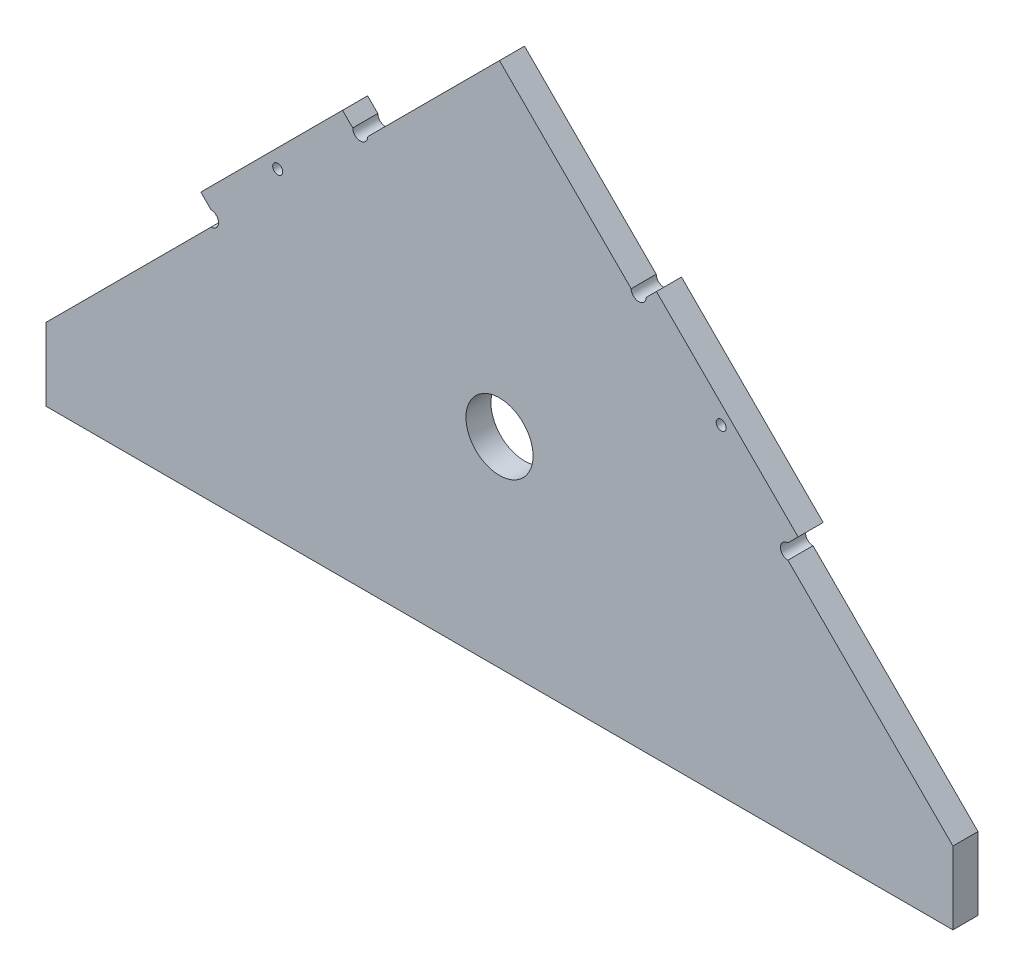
ISO-10303-21;
HEADER;
FILE_DESCRIPTION(('STEP AP214'),'2;1');
FILE_NAME('part.step','',(''),(''),'','','');
FILE_SCHEMA(('AUTOMOTIVE_DESIGN { 1 0 10303 214 1 1 1 1 }'));
ENDSEC;
DATA;
#1=APPLICATION_CONTEXT('core data for automotive mechanical design processes');
#2=APPLICATION_PROTOCOL_DEFINITION('international standard','automotive_design',2000,#1);
#3=PRODUCT_CONTEXT('',#1,'mechanical');
#4=PRODUCT('Part','Part','',(#3));
#5=PRODUCT_RELATED_PRODUCT_CATEGORY('part','',(#4));
#6=PRODUCT_DEFINITION_FORMATION('','',#4);
#7=PRODUCT_DEFINITION_CONTEXT('part definition',#1,'design');
#8=PRODUCT_DEFINITION('design','',#6,#7);
#9=PRODUCT_DEFINITION_SHAPE('','',#8);
#10=(LENGTH_UNIT() NAMED_UNIT(*) SI_UNIT(.MILLI.,.METRE.));
#11=(NAMED_UNIT(*) PLANE_ANGLE_UNIT() SI_UNIT($,.RADIAN.));
#12=(NAMED_UNIT(*) SI_UNIT($,.STERADIAN.) SOLID_ANGLE_UNIT());
#13=UNCERTAINTY_MEASURE_WITH_UNIT(LENGTH_MEASURE(1.E-05),#10,'distance_accuracy_value','');
#14=(GEOMETRIC_REPRESENTATION_CONTEXT(3) GLOBAL_UNCERTAINTY_ASSIGNED_CONTEXT((#13)) GLOBAL_UNIT_ASSIGNED_CONTEXT((#10,
#11,#12)) REPRESENTATION_CONTEXT('',''));
#15=CARTESIAN_POINT('',(0.,0.,0.));
#16=DIRECTION('',(0.,0.,1.));
#17=DIRECTION('',(1.,0.,0.));
#18=AXIS2_PLACEMENT_3D('',#15,#16,#17);
#19=CARTESIAN_POINT('',(-57.568542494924,48.9314575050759,5.));
#20=DIRECTION('',(0.,0.,-1.));
#21=DIRECTION('',(-1.,0.,0.));
#22=AXIS2_PLACEMENT_3D('',#19,#20,#21);
#23=PLANE('',#22);
#24=CARTESIAN_POINT('',(0.,40.,5.));
#25=DIRECTION('',(0.,0.,1.));
#26=DIRECTION('',(1.,0.,0.));
#27=AXIS2_PLACEMENT_3D('',#24,#25,#26);
#28=CIRCLE('',#27,6.7);
#29=CARTESIAN_POINT('',(6.7,40.,5.));
#30=VERTEX_POINT('',#29);
#31=EDGE_CURVE('E346',#30,#30,#28,.T.);
#32=ORIENTED_EDGE('',*,*,#31,.F.);
#33=EDGE_LOOP('',(#32));
#34=FACE_BOUND('',#33,.T.);
#35=CARTESIAN_POINT('',(-44.2533933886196,64.1223634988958,5.));
#36=DIRECTION('',(0.,0.,1.));
#37=DIRECTION('',(-1.,0.,0.));
#38=AXIS2_PLACEMENT_3D('',#35,#36,#37);
#39=CIRCLE('',#38,1.00000000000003);
#40=CARTESIAN_POINT('',(-45.2533933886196,64.1223634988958,5.));
#41=VERTEX_POINT('',#40);
#42=EDGE_CURVE('E188',#41,#41,#39,.T.);
#43=ORIENTED_EDGE('',*,*,#42,.F.);
#44=EDGE_LOOP('',(#43));
#45=FACE_BOUND('',#44,.T.);
#46=DIRECTION('',(-0.707106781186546,0.707106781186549,0.));
#47=VECTOR('',#46,1.);
#48=CARTESIAN_POINT('',(-29.2842712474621,78.7157287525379,5.));
#49=LINE('',#48,#47);
#50=CARTESIAN_POINT('',(-29.2842712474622,78.7157287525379,5.));
#51=VERTEX_POINT('',#50);
#52=CARTESIAN_POINT('',(-31.3198051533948,80.7512626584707,5.));
#53=VERTEX_POINT('',#52);
#54=EDGE_CURVE('E217',#51,#53,#49,.T.);
#55=ORIENTED_EDGE('',*,*,#54,.T.);
#56=DIRECTION('',(-0.707106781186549,-0.707106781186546,0.));
#57=VECTOR('',#56,1.);
#58=CARTESIAN_POINT('',(-31.3198051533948,80.7512626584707,5.));
#59=LINE('',#58,#57);
#60=CARTESIAN_POINT('',(-59.6040764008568,52.4669914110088,5.));
#61=VERTEX_POINT('',#60);
#62=EDGE_CURVE('E120',#53,#61,#59,.T.);
#63=ORIENTED_EDGE('',*,*,#62,.T.);
#64=DIRECTION('',(0.70710678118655,-0.707106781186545,0.));
#65=VECTOR('',#64,1.);
#66=CARTESIAN_POINT('',(-59.6040764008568,52.4669914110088,5.));
#67=LINE('',#66,#65);
#68=CARTESIAN_POINT('',(-57.5685424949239,50.4314575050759,5.));
#69=VERTEX_POINT('',#68);
#70=EDGE_CURVE('E260',#61,#69,#67,.T.);
#71=ORIENTED_EDGE('',*,*,#70,.T.);
#72=CARTESIAN_POINT('',(-57.568542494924,48.9314575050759,5.));
#73=DIRECTION('',(0.,0.,-1.));
#74=DIRECTION('',(-1.,0.,0.));
#75=AXIS2_PLACEMENT_3D('',#72,#73,#74);
#76=CIRCLE('',#75,1.5);
#77=CARTESIAN_POINT('',(-57.568542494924,47.4314575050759,5.));
#78=VERTEX_POINT('',#77);
#79=EDGE_CURVE('E279',#69,#78,#76,.T.);
#80=ORIENTED_EDGE('',*,*,#79,.T.);
#81=DIRECTION('',(-0.70710678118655,-0.707106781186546,0.));
#82=VECTOR('',#81,1.);
#83=CARTESIAN_POINT('',(-90.5,14.5,5.));
#84=LINE('',#83,#82);
#85=CARTESIAN_POINT('',(-90.5,14.5,5.));
#86=VERTEX_POINT('',#85);
#87=EDGE_CURVE('E276',#78,#86,#84,.T.);
#88=ORIENTED_EDGE('',*,*,#87,.T.);
#89=DIRECTION('',(0.,-1.,0.));
#90=VECTOR('',#89,1.);
#91=CARTESIAN_POINT('',(-90.5,0.,5.));
#92=LINE('',#91,#90);
#93=CARTESIAN_POINT('',(-90.5,0.,5.));
#94=VERTEX_POINT('',#93);
#95=EDGE_CURVE('E278',#86,#94,#92,.T.);
#96=ORIENTED_EDGE('',*,*,#95,.T.);
#97=DIRECTION('',(1.,0.,0.));
#98=VECTOR('',#97,1.);
#99=CARTESIAN_POINT('',(90.5,0.,5.));
#100=LINE('',#99,#98);
#101=CARTESIAN_POINT('',(90.5,0.,5.));
#102=VERTEX_POINT('',#101);
#103=EDGE_CURVE('E281',#94,#102,#100,.T.);
#104=ORIENTED_EDGE('',*,*,#103,.T.);
#105=DIRECTION('',(0.,1.,0.));
#106=VECTOR('',#105,1.);
#107=CARTESIAN_POINT('',(90.5,0.,5.));
#108=LINE('',#107,#106);
#109=CARTESIAN_POINT('',(90.5000000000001,14.5,5.));
#110=VERTEX_POINT('',#109);
#111=EDGE_CURVE('E287',#102,#110,#108,.T.);
#112=ORIENTED_EDGE('',*,*,#111,.T.);
#113=DIRECTION('',(-0.70710678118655,0.707106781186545,0.));
#114=VECTOR('',#113,1.);
#115=CARTESIAN_POINT('',(90.5000000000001,14.5,5.));
#116=LINE('',#115,#114);
#117=CARTESIAN_POINT('',(57.568542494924,47.4314575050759,5.));
#118=VERTEX_POINT('',#117);
#119=EDGE_CURVE('E289',#110,#118,#116,.T.);
#120=ORIENTED_EDGE('',*,*,#119,.T.);
#121=CARTESIAN_POINT('',(57.568542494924,48.9314575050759,5.));
#122=DIRECTION('',(0.,0.,-1.));
#123=DIRECTION('',(1.,0.,0.));
#124=AXIS2_PLACEMENT_3D('',#121,#122,#123);
#125=CIRCLE('',#124,1.5);
#126=CARTESIAN_POINT('',(57.5685424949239,50.4314575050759,5.));
#127=VERTEX_POINT('',#126);
#128=EDGE_CURVE('E291',#118,#127,#125,.T.);
#129=ORIENTED_EDGE('',*,*,#128,.T.);
#130=DIRECTION('',(0.707106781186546,0.707106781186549,0.));
#131=VECTOR('',#130,1.);
#132=CARTESIAN_POINT('',(59.6040764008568,52.4669914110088,5.));
#133=LINE('',#132,#131);
#134=CARTESIAN_POINT('',(59.6040764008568,52.4669914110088,5.));
#135=VERTEX_POINT('',#134);
#136=EDGE_CURVE('E293',#127,#135,#133,.T.);
#137=ORIENTED_EDGE('',*,*,#136,.T.);
#138=DIRECTION('',(-0.707106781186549,0.707106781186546,0.));
#139=VECTOR('',#138,1.);
#140=CARTESIAN_POINT('',(31.3198051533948,80.7512626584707,5.));
#141=LINE('',#140,#139);
#142=CARTESIAN_POINT('',(31.3198051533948,80.7512626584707,5.));
#143=VERTEX_POINT('',#142);
#144=EDGE_CURVE('E295',#135,#143,#141,.T.);
#145=ORIENTED_EDGE('',*,*,#144,.T.);
#146=DIRECTION('',(-0.707106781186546,-0.707106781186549,0.));
#147=VECTOR('',#146,1.);
#148=CARTESIAN_POINT('',(29.2842712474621,78.7157287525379,5.));
#149=LINE('',#148,#147);
#150=CARTESIAN_POINT('',(29.2842712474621,78.7157287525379,5.));
#151=VERTEX_POINT('',#150);
#152=EDGE_CURVE('E297',#143,#151,#149,.T.);
#153=ORIENTED_EDGE('',*,*,#152,.T.);
#154=CARTESIAN_POINT('',(27.784271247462,78.7157287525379,5.));
#155=DIRECTION('',(0.,0.,-1.));
#156=DIRECTION('',(1.,0.,0.));
#157=AXIS2_PLACEMENT_3D('',#154,#155,#156);
#158=CIRCLE('',#157,1.50000000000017);
#159=CARTESIAN_POINT('',(26.2842712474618,78.7157287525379,5.));
#160=VERTEX_POINT('',#159);
#161=EDGE_CURVE('E166',#151,#160,#158,.T.);
#162=ORIENTED_EDGE('',*,*,#161,.T.);
#163=DIRECTION('',(-0.70710678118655,0.707106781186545,0.));
#164=VECTOR('',#163,1.);
#165=CARTESIAN_POINT('',(26.2842712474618,78.7157287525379,5.));
#166=LINE('',#165,#164);
#167=CARTESIAN_POINT('',(0.,105.,5.));
#168=VERTEX_POINT('',#167);
#169=EDGE_CURVE('E160',#160,#168,#166,.T.);
#170=ORIENTED_EDGE('',*,*,#169,.T.);
#171=DIRECTION('',(-0.707106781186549,-0.707106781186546,0.));
#172=VECTOR('',#171,1.);
#173=CARTESIAN_POINT('',(-26.2842712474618,78.7157287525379,5.));
#174=LINE('',#173,#172);
#175=CARTESIAN_POINT('',(-26.2842712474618,78.7157287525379,5.));
#176=VERTEX_POINT('',#175);
#177=EDGE_CURVE('E164',#168,#176,#174,.T.);
#178=ORIENTED_EDGE('',*,*,#177,.T.);
#179=CARTESIAN_POINT('',(-27.784271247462,78.7157287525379,5.));
#180=DIRECTION('',(0.,0.,-1.));
#181=DIRECTION('',(-1.,0.,0.));
#182=AXIS2_PLACEMENT_3D('',#179,#180,#181);
#183=CIRCLE('',#182,1.50000000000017);
#184=EDGE_CURVE('E50',#176,#51,#183,.T.);
#185=ORIENTED_EDGE('',*,*,#184,.T.);
#186=EDGE_LOOP('',(#55,#63,#71,#80,#88,#96,#104,#112,#120,#129,#137,#145,#153,#162,#170,#178,#185));
#187=FACE_BOUND('',#186,.T.);
#188=CARTESIAN_POINT('',(44.2533933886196,64.1223634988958,5.));
#189=DIRECTION('',(0.,0.,1.));
#190=DIRECTION('',(1.,0.,0.));
#191=AXIS2_PLACEMENT_3D('',#188,#189,#190);
#192=CIRCLE('',#191,1.00000000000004);
#193=CARTESIAN_POINT('',(45.2533933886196,64.1223634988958,5.));
#194=VERTEX_POINT('',#193);
#195=EDGE_CURVE('E350',#194,#194,#192,.T.);
#196=ORIENTED_EDGE('',*,*,#195,.F.);
#197=EDGE_LOOP('',(#196));
#198=FACE_BOUND('',#197,.T.);
#199=ADVANCED_FACE('F32',(#34,#45,#187,#198),#23,.F.);
#200=CARTESIAN_POINT('',(-57.568542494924,48.9314575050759,0.));
#201=DIRECTION('',(0.,0.,-1.));
#202=DIRECTION('',(-1.,0.,0.));
#203=AXIS2_PLACEMENT_3D('',#200,#201,#202);
#204=PLANE('',#203);
#205=CARTESIAN_POINT('',(0.,40.,0.));
#206=DIRECTION('',(0.,0.,-1.));
#207=DIRECTION('',(-1.,0.,0.));
#208=AXIS2_PLACEMENT_3D('',#205,#206,#207);
#209=CIRCLE('',#208,6.7);
#210=CARTESIAN_POINT('',(-6.7,40.,0.));
#211=VERTEX_POINT('',#210);
#212=EDGE_CURVE('E36',#211,#211,#209,.T.);
#213=ORIENTED_EDGE('',*,*,#212,.F.);
#214=EDGE_LOOP('',(#213));
#215=FACE_BOUND('',#214,.T.);
#216=CARTESIAN_POINT('',(-44.2533933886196,64.1223634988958,0.));
#217=DIRECTION('',(0.,0.,1.));
#218=DIRECTION('',(-1.,0.,0.));
#219=AXIS2_PLACEMENT_3D('',#216,#217,#218);
#220=CIRCLE('',#219,1.00000000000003);
#221=CARTESIAN_POINT('',(-45.2533933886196,64.1223634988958,0.));
#222=VERTEX_POINT('',#221);
#223=EDGE_CURVE('E353',#222,#222,#220,.T.);
#224=ORIENTED_EDGE('',*,*,#223,.T.);
#225=EDGE_LOOP('',(#224));
#226=FACE_BOUND('',#225,.T.);
#227=DIRECTION('',(-0.707106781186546,0.707106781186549,0.));
#228=VECTOR('',#227,1.);
#229=CARTESIAN_POINT('',(-29.2842712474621,78.7157287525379,0.));
#230=LINE('',#229,#228);
#231=CARTESIAN_POINT('',(-29.2842712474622,78.7157287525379,0.));
#232=VERTEX_POINT('',#231);
#233=CARTESIAN_POINT('',(-31.3198051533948,80.7512626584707,0.));
#234=VERTEX_POINT('',#233);
#235=EDGE_CURVE('E184',#232,#234,#230,.T.);
#236=ORIENTED_EDGE('',*,*,#235,.F.);
#237=CARTESIAN_POINT('',(-27.784271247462,78.7157287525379,0.));
#238=DIRECTION('',(0.,0.,-1.));
#239=DIRECTION('',(-1.,0.,0.));
#240=AXIS2_PLACEMENT_3D('',#237,#238,#239);
#241=CIRCLE('',#240,1.50000000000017);
#242=CARTESIAN_POINT('',(-26.2842712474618,78.7157287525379,0.));
#243=VERTEX_POINT('',#242);
#244=EDGE_CURVE('E112',#243,#232,#241,.T.);
#245=ORIENTED_EDGE('',*,*,#244,.F.);
#246=DIRECTION('',(-0.707106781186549,-0.707106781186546,0.));
#247=VECTOR('',#246,1.);
#248=CARTESIAN_POINT('',(-26.2842712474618,78.7157287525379,0.));
#249=LINE('',#248,#247);
#250=CARTESIAN_POINT('',(0.,105.,0.));
#251=VERTEX_POINT('',#250);
#252=EDGE_CURVE('E106',#251,#243,#249,.T.);
#253=ORIENTED_EDGE('',*,*,#252,.F.);
#254=DIRECTION('',(-0.70710678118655,0.707106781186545,0.));
#255=VECTOR('',#254,1.);
#256=CARTESIAN_POINT('',(26.2842712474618,78.7157287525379,0.));
#257=LINE('',#256,#255);
#258=CARTESIAN_POINT('',(26.2842712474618,78.7157287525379,0.));
#259=VERTEX_POINT('',#258);
#260=EDGE_CURVE('E174',#259,#251,#257,.T.);
#261=ORIENTED_EDGE('',*,*,#260,.F.);
#262=CARTESIAN_POINT('',(27.784271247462,78.7157287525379,0.));
#263=DIRECTION('',(0.,0.,-1.));
#264=DIRECTION('',(1.,0.,0.));
#265=AXIS2_PLACEMENT_3D('',#262,#263,#264);
#266=CIRCLE('',#265,1.50000000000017);
#267=CARTESIAN_POINT('',(29.2842712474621,78.7157287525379,0.));
#268=VERTEX_POINT('',#267);
#269=EDGE_CURVE('E212',#268,#259,#266,.T.);
#270=ORIENTED_EDGE('',*,*,#269,.F.);
#271=DIRECTION('',(-0.707106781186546,-0.707106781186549,0.));
#272=VECTOR('',#271,1.);
#273=CARTESIAN_POINT('',(29.2842712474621,78.7157287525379,0.));
#274=LINE('',#273,#272);
#275=CARTESIAN_POINT('',(31.3198051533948,80.7512626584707,0.));
#276=VERTEX_POINT('',#275);
#277=EDGE_CURVE('E210',#276,#268,#274,.T.);
#278=ORIENTED_EDGE('',*,*,#277,.F.);
#279=DIRECTION('',(-0.707106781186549,0.707106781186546,0.));
#280=VECTOR('',#279,1.);
#281=CARTESIAN_POINT('',(31.3198051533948,80.7512626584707,0.));
#282=LINE('',#281,#280);
#283=CARTESIAN_POINT('',(59.6040764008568,52.4669914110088,0.));
#284=VERTEX_POINT('',#283);
#285=EDGE_CURVE('E208',#284,#276,#282,.T.);
#286=ORIENTED_EDGE('',*,*,#285,.F.);
#287=DIRECTION('',(0.707106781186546,0.707106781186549,0.));
#288=VECTOR('',#287,1.);
#289=CARTESIAN_POINT('',(59.6040764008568,52.4669914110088,0.));
#290=LINE('',#289,#288);
#291=CARTESIAN_POINT('',(57.5685424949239,50.4314575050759,0.));
#292=VERTEX_POINT('',#291);
#293=EDGE_CURVE('E206',#292,#284,#290,.T.);
#294=ORIENTED_EDGE('',*,*,#293,.F.);
#295=CARTESIAN_POINT('',(57.568542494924,48.9314575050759,0.));
#296=DIRECTION('',(0.,0.,-1.));
#297=DIRECTION('',(1.,0.,0.));
#298=AXIS2_PLACEMENT_3D('',#295,#296,#297);
#299=CIRCLE('',#298,1.5);
#300=CARTESIAN_POINT('',(57.568542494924,47.4314575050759,0.));
#301=VERTEX_POINT('',#300);
#302=EDGE_CURVE('E204',#301,#292,#299,.T.);
#303=ORIENTED_EDGE('',*,*,#302,.F.);
#304=DIRECTION('',(-0.70710678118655,0.707106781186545,0.));
#305=VECTOR('',#304,1.);
#306=CARTESIAN_POINT('',(90.5000000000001,14.5,0.));
#307=LINE('',#306,#305);
#308=CARTESIAN_POINT('',(90.5000000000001,14.5,0.));
#309=VERTEX_POINT('',#308);
#310=EDGE_CURVE('E202',#309,#301,#307,.T.);
#311=ORIENTED_EDGE('',*,*,#310,.F.);
#312=DIRECTION('',(0.,1.,0.));
#313=VECTOR('',#312,1.);
#314=CARTESIAN_POINT('',(90.5,0.,0.));
#315=LINE('',#314,#313);
#316=CARTESIAN_POINT('',(90.5,0.,0.));
#317=VERTEX_POINT('',#316);
#318=EDGE_CURVE('E200',#317,#309,#315,.T.);
#319=ORIENTED_EDGE('',*,*,#318,.F.);
#320=DIRECTION('',(1.,0.,0.));
#321=VECTOR('',#320,1.);
#322=CARTESIAN_POINT('',(90.5,0.,0.));
#323=LINE('',#322,#321);
#324=CARTESIAN_POINT('',(-90.5,0.,0.));
#325=VERTEX_POINT('',#324);
#326=EDGE_CURVE('E198',#325,#317,#323,.T.);
#327=ORIENTED_EDGE('',*,*,#326,.F.);
#328=DIRECTION('',(0.,-1.,0.));
#329=VECTOR('',#328,1.);
#330=CARTESIAN_POINT('',(-90.5,0.,0.));
#331=LINE('',#330,#329);
#332=CARTESIAN_POINT('',(-90.5,14.5,0.));
#333=VERTEX_POINT('',#332);
#334=EDGE_CURVE('E196',#333,#325,#331,.T.);
#335=ORIENTED_EDGE('',*,*,#334,.F.);
#336=DIRECTION('',(-0.70710678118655,-0.707106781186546,0.));
#337=VECTOR('',#336,1.);
#338=CARTESIAN_POINT('',(-90.5,14.5,0.));
#339=LINE('',#338,#337);
#340=CARTESIAN_POINT('',(-57.568542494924,47.4314575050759,0.));
#341=VERTEX_POINT('',#340);
#342=EDGE_CURVE('E194',#341,#333,#339,.T.);
#343=ORIENTED_EDGE('',*,*,#342,.F.);
#344=CARTESIAN_POINT('',(-57.568542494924,48.9314575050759,0.));
#345=DIRECTION('',(0.,0.,-1.));
#346=DIRECTION('',(-1.,0.,0.));
#347=AXIS2_PLACEMENT_3D('',#344,#345,#346);
#348=CIRCLE('',#347,1.5);
#349=CARTESIAN_POINT('',(-57.5685424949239,50.4314575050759,0.));
#350=VERTEX_POINT('',#349);
#351=EDGE_CURVE('E192',#350,#341,#348,.T.);
#352=ORIENTED_EDGE('',*,*,#351,.F.);
#353=DIRECTION('',(0.70710678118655,-0.707106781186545,0.));
#354=VECTOR('',#353,1.);
#355=CARTESIAN_POINT('',(-59.6040764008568,52.4669914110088,0.));
#356=LINE('',#355,#354);
#357=CARTESIAN_POINT('',(-59.6040764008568,52.4669914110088,0.));
#358=VERTEX_POINT('',#357);
#359=EDGE_CURVE('E190',#358,#350,#356,.T.);
#360=ORIENTED_EDGE('',*,*,#359,.F.);
#361=DIRECTION('',(-0.707106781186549,-0.707106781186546,0.));
#362=VECTOR('',#361,1.);
#363=CARTESIAN_POINT('',(-31.3198051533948,80.7512626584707,0.));
#364=LINE('',#363,#362);
#365=EDGE_CURVE('E187',#234,#358,#364,.T.);
#366=ORIENTED_EDGE('',*,*,#365,.F.);
#367=EDGE_LOOP('',(#236,#245,#253,#261,#270,#278,#286,#294,#303,#311,#319,#327,#335,#343,#352,
#360,#366));
#368=FACE_BOUND('',#367,.T.);
#369=CARTESIAN_POINT('',(44.2533933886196,64.1223634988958,0.));
#370=DIRECTION('',(0.,0.,1.));
#371=DIRECTION('',(1.,0.,0.));
#372=AXIS2_PLACEMENT_3D('',#369,#370,#371);
#373=CIRCLE('',#372,1.00000000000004);
#374=CARTESIAN_POINT('',(45.2533933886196,64.1223634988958,0.));
#375=VERTEX_POINT('',#374);
#376=EDGE_CURVE('E348',#375,#375,#373,.T.);
#377=ORIENTED_EDGE('',*,*,#376,.T.);
#378=EDGE_LOOP('',(#377));
#379=FACE_BOUND('',#378,.T.);
#380=ADVANCED_FACE('F264',(#215,#226,#368,#379),#204,.T.);
#381=CARTESIAN_POINT('',(-29.2842712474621,78.7157287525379,5.));
#382=DIRECTION('',(-0.707106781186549,-0.707106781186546,0.));
#383=DIRECTION('',(0.707106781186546,-0.707106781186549,0.));
#384=AXIS2_PLACEMENT_3D('',#381,#382,#383);
#385=PLANE('',#384);
#386=ORIENTED_EDGE('',*,*,#235,.T.);
#387=DIRECTION('',(0.,0.,-1.));
#388=VECTOR('',#387,1.);
#389=CARTESIAN_POINT('',(-31.3198051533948,80.7512626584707,5.));
#390=LINE('',#389,#388);
#391=EDGE_CURVE('E11',#53,#234,#390,.T.);
#392=ORIENTED_EDGE('',*,*,#391,.F.);
#393=ORIENTED_EDGE('',*,*,#54,.F.);
#394=DIRECTION('',(0.,0.,-1.));
#395=VECTOR('',#394,1.);
#396=CARTESIAN_POINT('',(-29.2842712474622,78.7157287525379,5.));
#397=LINE('',#396,#395);
#398=EDGE_CURVE('E180',#51,#232,#397,.T.);
#399=ORIENTED_EDGE('',*,*,#398,.T.);
#400=EDGE_LOOP('',(#386,#392,#393,#399));
#401=FACE_BOUND('',#400,.T.);
#402=ADVANCED_FACE('F34',(#401),#385,.F.);
#403=CARTESIAN_POINT('',(-31.3198051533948,80.7512626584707,5.));
#404=DIRECTION('',(0.707106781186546,-0.707106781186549,0.));
#405=DIRECTION('',(0.707106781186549,0.707106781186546,0.));
#406=AXIS2_PLACEMENT_3D('',#403,#404,#405);
#407=PLANE('',#406);
#408=ORIENTED_EDGE('',*,*,#365,.T.);
#409=DIRECTION('',(0.,0.,-1.));
#410=VECTOR('',#409,1.);
#411=CARTESIAN_POINT('',(-59.6040764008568,52.4669914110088,5.));
#412=LINE('',#411,#410);
#413=EDGE_CURVE('E42',#61,#358,#412,.T.);
#414=ORIENTED_EDGE('',*,*,#413,.F.);
#415=ORIENTED_EDGE('',*,*,#62,.F.);
#416=ORIENTED_EDGE('',*,*,#391,.T.);
#417=EDGE_LOOP('',(#408,#414,#415,#416));
#418=FACE_BOUND('',#417,.T.);
#419=ADVANCED_FACE('F506',(#418),#407,.F.);
#420=CARTESIAN_POINT('',(-59.6040764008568,52.4669914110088,5.));
#421=DIRECTION('',(0.707106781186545,0.70710678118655,0.));
#422=DIRECTION('',(-0.70710678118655,0.707106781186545,0.));
#423=AXIS2_PLACEMENT_3D('',#420,#421,#422);
#424=PLANE('',#423);
#425=ORIENTED_EDGE('',*,*,#359,.T.);
#426=DIRECTION('',(0.,0.,-1.));
#427=VECTOR('',#426,1.);
#428=CARTESIAN_POINT('',(-57.5685424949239,50.4314575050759,5.));
#429=LINE('',#428,#427);
#430=EDGE_CURVE('E251',#69,#350,#429,.T.);
#431=ORIENTED_EDGE('',*,*,#430,.F.);
#432=ORIENTED_EDGE('',*,*,#70,.F.);
#433=ORIENTED_EDGE('',*,*,#413,.T.);
#434=EDGE_LOOP('',(#425,#431,#432,#433));
#435=FACE_BOUND('',#434,.T.);
#436=ADVANCED_FACE('F258',(#435),#424,.F.);
#437=CARTESIAN_POINT('',(-57.568542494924,48.9314575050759,5.));
#438=DIRECTION('',(0.,0.,-1.));
#439=DIRECTION('',(-1.,0.,0.));
#440=AXIS2_PLACEMENT_3D('',#437,#438,#439);
#441=CYLINDRICAL_SURFACE('',#440,1.5);
#442=ORIENTED_EDGE('',*,*,#351,.T.);
#443=DIRECTION('',(0.,0.,-1.));
#444=VECTOR('',#443,1.);
#445=CARTESIAN_POINT('',(-57.568542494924,47.4314575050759,5.));
#446=LINE('',#445,#444);
#447=EDGE_CURVE('E248',#78,#341,#446,.T.);
#448=ORIENTED_EDGE('',*,*,#447,.F.);
#449=ORIENTED_EDGE('',*,*,#79,.F.);
#450=ORIENTED_EDGE('',*,*,#430,.T.);
#451=EDGE_LOOP('',(#442,#448,#449,#450));
#452=FACE_BOUND('',#451,.T.);
#453=ADVANCED_FACE('F270',(#452),#441,.F.);
#454=CARTESIAN_POINT('',(-90.5,14.5,5.));
#455=DIRECTION('',(0.707106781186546,-0.70710678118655,0.));
#456=DIRECTION('',(0.70710678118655,0.707106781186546,0.));
#457=AXIS2_PLACEMENT_3D('',#454,#455,#456);
#458=PLANE('',#457);
#459=ORIENTED_EDGE('',*,*,#342,.T.);
#460=DIRECTION('',(0.,0.,-1.));
#461=VECTOR('',#460,1.);
#462=CARTESIAN_POINT('',(-90.5,14.5,5.));
#463=LINE('',#462,#461);
#464=EDGE_CURVE('E245',#86,#333,#463,.T.);
#465=ORIENTED_EDGE('',*,*,#464,.F.);
#466=ORIENTED_EDGE('',*,*,#87,.F.);
#467=ORIENTED_EDGE('',*,*,#447,.T.);
#468=EDGE_LOOP('',(#459,#465,#466,#467));
#469=FACE_BOUND('',#468,.T.);
#470=ADVANCED_FACE('F274',(#469),#458,.F.);
#471=CARTESIAN_POINT('',(-90.5,0.,5.));
#472=DIRECTION('',(1.,0.,0.));
#473=DIRECTION('',(0.,1.,0.));
#474=AXIS2_PLACEMENT_3D('',#471,#472,#473);
#475=PLANE('',#474);
#476=ORIENTED_EDGE('',*,*,#334,.T.);
#477=DIRECTION('',(0.,0.,-1.));
#478=VECTOR('',#477,1.);
#479=CARTESIAN_POINT('',(-90.5,0.,5.));
#480=LINE('',#479,#478);
#481=EDGE_CURVE('E242',#94,#325,#480,.T.);
#482=ORIENTED_EDGE('',*,*,#481,.F.);
#483=ORIENTED_EDGE('',*,*,#95,.F.);
#484=ORIENTED_EDGE('',*,*,#464,.T.);
#485=EDGE_LOOP('',(#476,#482,#483,#484));
#486=FACE_BOUND('',#485,.T.);
#487=ADVANCED_FACE('F471',(#486),#475,.F.);
#488=CARTESIAN_POINT('',(90.5,0.,5.));
#489=DIRECTION('',(0.,1.,0.));
#490=DIRECTION('',(-1.,0.,0.));
#491=AXIS2_PLACEMENT_3D('',#488,#489,#490);
#492=PLANE('',#491);
#493=ORIENTED_EDGE('',*,*,#326,.T.);
#494=DIRECTION('',(0.,0.,-1.));
#495=VECTOR('',#494,1.);
#496=CARTESIAN_POINT('',(90.5,0.,5.));
#497=LINE('',#496,#495);
#498=EDGE_CURVE('E239',#102,#317,#497,.T.);
#499=ORIENTED_EDGE('',*,*,#498,.F.);
#500=ORIENTED_EDGE('',*,*,#103,.F.);
#501=ORIENTED_EDGE('',*,*,#481,.T.);
#502=EDGE_LOOP('',(#493,#499,#500,#501));
#503=FACE_BOUND('',#502,.T.);
#504=ADVANCED_FACE('F461',(#503),#492,.F.);
#505=CARTESIAN_POINT('',(90.5,0.,5.));
#506=DIRECTION('',(-1.,0.,0.));
#507=DIRECTION('',(0.,-1.,0.));
#508=AXIS2_PLACEMENT_3D('',#505,#506,#507);
#509=PLANE('',#508);
#510=ORIENTED_EDGE('',*,*,#318,.T.);
#511=DIRECTION('',(0.,0.,-1.));
#512=VECTOR('',#511,1.);
#513=CARTESIAN_POINT('',(90.5000000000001,14.5,5.));
#514=LINE('',#513,#512);
#515=EDGE_CURVE('E236',#110,#309,#514,.T.);
#516=ORIENTED_EDGE('',*,*,#515,.F.);
#517=ORIENTED_EDGE('',*,*,#111,.F.);
#518=ORIENTED_EDGE('',*,*,#498,.T.);
#519=EDGE_LOOP('',(#510,#516,#517,#518));
#520=FACE_BOUND('',#519,.T.);
#521=ADVANCED_FACE('F451',(#520),#509,.F.);
#522=CARTESIAN_POINT('',(90.5000000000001,14.5,5.));
#523=DIRECTION('',(-0.707106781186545,-0.70710678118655,0.));
#524=DIRECTION('',(0.70710678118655,-0.707106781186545,0.));
#525=AXIS2_PLACEMENT_3D('',#522,#523,#524);
#526=PLANE('',#525);
#527=ORIENTED_EDGE('',*,*,#310,.T.);
#528=DIRECTION('',(0.,0.,-1.));
#529=VECTOR('',#528,1.);
#530=CARTESIAN_POINT('',(57.568542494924,47.4314575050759,5.));
#531=LINE('',#530,#529);
#532=EDGE_CURVE('E233',#118,#301,#531,.T.);
#533=ORIENTED_EDGE('',*,*,#532,.F.);
#534=ORIENTED_EDGE('',*,*,#119,.F.);
#535=ORIENTED_EDGE('',*,*,#515,.T.);
#536=EDGE_LOOP('',(#527,#533,#534,#535));
#537=FACE_BOUND('',#536,.T.);
#538=ADVANCED_FACE('F441',(#537),#526,.F.);
#539=CARTESIAN_POINT('',(57.568542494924,48.9314575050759,5.));
#540=DIRECTION('',(0.,0.,-1.));
#541=DIRECTION('',(-1.,0.,0.));
#542=AXIS2_PLACEMENT_3D('',#539,#540,#541);
#543=CYLINDRICAL_SURFACE('',#542,1.5);
#544=ORIENTED_EDGE('',*,*,#302,.T.);
#545=DIRECTION('',(0.,0.,-1.));
#546=VECTOR('',#545,1.);
#547=CARTESIAN_POINT('',(57.5685424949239,50.4314575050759,5.));
#548=LINE('',#547,#546);
#549=EDGE_CURVE('E230',#127,#292,#548,.T.);
#550=ORIENTED_EDGE('',*,*,#549,.F.);
#551=ORIENTED_EDGE('',*,*,#128,.F.);
#552=ORIENTED_EDGE('',*,*,#532,.T.);
#553=EDGE_LOOP('',(#544,#550,#551,#552));
#554=FACE_BOUND('',#553,.T.);
#555=ADVANCED_FACE('F431',(#554),#543,.F.);
#556=CARTESIAN_POINT('',(59.6040764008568,52.4669914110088,5.));
#557=DIRECTION('',(-0.707106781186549,0.707106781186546,0.));
#558=DIRECTION('',(-0.707106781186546,-0.707106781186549,0.));
#559=AXIS2_PLACEMENT_3D('',#556,#557,#558);
#560=PLANE('',#559);
#561=ORIENTED_EDGE('',*,*,#293,.T.);
#562=DIRECTION('',(0.,0.,-1.));
#563=VECTOR('',#562,1.);
#564=CARTESIAN_POINT('',(59.6040764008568,52.4669914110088,5.));
#565=LINE('',#564,#563);
#566=EDGE_CURVE('E227',#135,#284,#565,.T.);
#567=ORIENTED_EDGE('',*,*,#566,.F.);
#568=ORIENTED_EDGE('',*,*,#136,.F.);
#569=ORIENTED_EDGE('',*,*,#549,.T.);
#570=EDGE_LOOP('',(#561,#567,#568,#569));
#571=FACE_BOUND('',#570,.T.);
#572=ADVANCED_FACE('F421',(#571),#560,.F.);
#573=CARTESIAN_POINT('',(31.3198051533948,80.7512626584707,5.));
#574=DIRECTION('',(-0.707106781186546,-0.707106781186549,0.));
#575=DIRECTION('',(0.707106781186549,-0.707106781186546,0.));
#576=AXIS2_PLACEMENT_3D('',#573,#574,#575);
#577=PLANE('',#576);
#578=ORIENTED_EDGE('',*,*,#285,.T.);
#579=DIRECTION('',(0.,0.,-1.));
#580=VECTOR('',#579,1.);
#581=CARTESIAN_POINT('',(31.3198051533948,80.7512626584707,5.));
#582=LINE('',#581,#580);
#583=EDGE_CURVE('E224',#143,#276,#582,.T.);
#584=ORIENTED_EDGE('',*,*,#583,.F.);
#585=ORIENTED_EDGE('',*,*,#144,.F.);
#586=ORIENTED_EDGE('',*,*,#566,.T.);
#587=EDGE_LOOP('',(#578,#584,#585,#586));
#588=FACE_BOUND('',#587,.T.);
#589=ADVANCED_FACE('F412',(#588),#577,.F.);
#590=CARTESIAN_POINT('',(29.2842712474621,78.7157287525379,5.));
#591=DIRECTION('',(0.707106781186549,-0.707106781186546,0.));
#592=DIRECTION('',(0.707106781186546,0.707106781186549,0.));
#593=AXIS2_PLACEMENT_3D('',#590,#591,#592);
#594=PLANE('',#593);
#595=ORIENTED_EDGE('',*,*,#277,.T.);
#596=DIRECTION('',(0.,0.,-1.));
#597=VECTOR('',#596,1.);
#598=CARTESIAN_POINT('',(29.2842712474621,78.7157287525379,5.));
#599=LINE('',#598,#597);
#600=EDGE_CURVE('E221',#151,#268,#599,.T.);
#601=ORIENTED_EDGE('',*,*,#600,.F.);
#602=ORIENTED_EDGE('',*,*,#152,.F.);
#603=ORIENTED_EDGE('',*,*,#583,.T.);
#604=EDGE_LOOP('',(#595,#601,#602,#603));
#605=FACE_BOUND('',#604,.T.);
#606=ADVANCED_FACE('F303',(#605),#594,.F.);
#607=CARTESIAN_POINT('',(27.784271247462,78.7157287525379,5.));
#608=DIRECTION('',(0.,0.,-1.));
#609=DIRECTION('',(-1.,0.,0.));
#610=AXIS2_PLACEMENT_3D('',#607,#608,#609);
#611=CYLINDRICAL_SURFACE('',#610,1.50000000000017);
#612=ORIENTED_EDGE('',*,*,#269,.T.);
#613=DIRECTION('',(0.,0.,-1.));
#614=VECTOR('',#613,1.);
#615=CARTESIAN_POINT('',(26.2842712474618,78.7157287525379,5.));
#616=LINE('',#615,#614);
#617=EDGE_CURVE('E175',#160,#259,#616,.T.);
#618=ORIENTED_EDGE('',*,*,#617,.F.);
#619=ORIENTED_EDGE('',*,*,#161,.F.);
#620=ORIENTED_EDGE('',*,*,#600,.T.);
#621=EDGE_LOOP('',(#612,#618,#619,#620));
#622=FACE_BOUND('',#621,.T.);
#623=ADVANCED_FACE('F307',(#622),#611,.F.);
#624=CARTESIAN_POINT('',(26.2842712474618,78.7157287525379,5.));
#625=DIRECTION('',(-0.707106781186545,-0.70710678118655,0.));
#626=DIRECTION('',(0.70710678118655,-0.707106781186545,0.));
#627=AXIS2_PLACEMENT_3D('',#624,#625,#626);
#628=PLANE('',#627);
#629=ORIENTED_EDGE('',*,*,#260,.T.);
#630=DIRECTION('',(0.,0.,-1.));
#631=VECTOR('',#630,1.);
#632=CARTESIAN_POINT('',(0.,105.,5.));
#633=LINE('',#632,#631);
#634=EDGE_CURVE('E171',#168,#251,#633,.T.);
#635=ORIENTED_EDGE('',*,*,#634,.F.);
#636=ORIENTED_EDGE('',*,*,#169,.F.);
#637=ORIENTED_EDGE('',*,*,#617,.T.);
#638=EDGE_LOOP('',(#629,#635,#636,#637));
#639=FACE_BOUND('',#638,.T.);
#640=ADVANCED_FACE('F172',(#639),#628,.F.);
#641=CARTESIAN_POINT('',(-26.2842712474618,78.7157287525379,5.));
#642=DIRECTION('',(0.707106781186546,-0.707106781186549,0.));
#643=DIRECTION('',(0.707106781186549,0.707106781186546,0.));
#644=AXIS2_PLACEMENT_3D('',#641,#642,#643);
#645=PLANE('',#644);
#646=ORIENTED_EDGE('',*,*,#252,.T.);
#647=DIRECTION('',(0.,0.,-1.));
#648=VECTOR('',#647,1.);
#649=CARTESIAN_POINT('',(-26.2842712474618,78.7157287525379,5.));
#650=LINE('',#649,#648);
#651=EDGE_CURVE('E176',#176,#243,#650,.T.);
#652=ORIENTED_EDGE('',*,*,#651,.F.);
#653=ORIENTED_EDGE('',*,*,#177,.F.);
#654=ORIENTED_EDGE('',*,*,#634,.T.);
#655=EDGE_LOOP('',(#646,#652,#653,#654));
#656=FACE_BOUND('',#655,.T.);
#657=ADVANCED_FACE('F178',(#656),#645,.F.);
#658=CARTESIAN_POINT('',(-27.784271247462,78.7157287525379,5.));
#659=DIRECTION('',(0.,0.,-1.));
#660=DIRECTION('',(-1.,0.,0.));
#661=AXIS2_PLACEMENT_3D('',#658,#659,#660);
#662=CYLINDRICAL_SURFACE('',#661,1.50000000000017);
#663=ORIENTED_EDGE('',*,*,#244,.T.);
#664=ORIENTED_EDGE('',*,*,#398,.F.);
#665=ORIENTED_EDGE('',*,*,#184,.F.);
#666=ORIENTED_EDGE('',*,*,#651,.T.);
#667=EDGE_LOOP('',(#663,#664,#665,#666));
#668=FACE_BOUND('',#667,.T.);
#669=ADVANCED_FACE('F311',(#668),#662,.F.);
#670=CARTESIAN_POINT('',(-44.2533933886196,64.1223634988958,5.));
#671=DIRECTION('',(0.,0.,-1.));
#672=DIRECTION('',(-1.,0.,0.));
#673=AXIS2_PLACEMENT_3D('',#670,#671,#672);
#674=CYLINDRICAL_SURFACE('',#673,1.00000000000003);
#675=ORIENTED_EDGE('',*,*,#42,.T.);
#676=EDGE_LOOP('',(#675));
#677=FACE_BOUND('',#676,.T.);
#678=ORIENTED_EDGE('',*,*,#223,.F.);
#679=EDGE_LOOP('',(#678));
#680=FACE_BOUND('',#679,.T.);
#681=ADVANCED_FACE('F313',(#677,#680),#674,.F.);
#682=CARTESIAN_POINT('',(44.2533933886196,64.1223634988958,5.));
#683=DIRECTION('',(0.,0.,-1.));
#684=DIRECTION('',(-1.,0.,0.));
#685=AXIS2_PLACEMENT_3D('',#682,#683,#684);
#686=CYLINDRICAL_SURFACE('',#685,1.00000000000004);
#687=ORIENTED_EDGE('',*,*,#195,.T.);
#688=EDGE_LOOP('',(#687));
#689=FACE_BOUND('',#688,.T.);
#690=ORIENTED_EDGE('',*,*,#376,.F.);
#691=EDGE_LOOP('',(#690));
#692=FACE_BOUND('',#691,.T.);
#693=ADVANCED_FACE('F319',(#689,#692),#686,.F.);
#694=CARTESIAN_POINT('',(0.,40.,-5.));
#695=DIRECTION('',(0.,0.,1.));
#696=DIRECTION('',(1.,0.,0.));
#697=AXIS2_PLACEMENT_3D('',#694,#695,#696);
#698=CYLINDRICAL_SURFACE('',#697,6.7);
#699=ORIENTED_EDGE('',*,*,#212,.T.);
#700=EDGE_LOOP('',(#699));
#701=FACE_BOUND('',#700,.T.);
#702=ORIENTED_EDGE('',*,*,#31,.T.);
#703=EDGE_LOOP('',(#702));
#704=FACE_BOUND('',#703,.T.);
#705=ADVANCED_FACE('F336',(#701,#704),#698,.F.);
#706=CLOSED_SHELL('',(#199,#380,#402,#419,#436,#453,#470,#487,#504,#521,#538,#555,#572,#589,
#606,#623,#640,#657,#669,#681,#693,#705));
#707=MANIFOLD_SOLID_BREP('B2',#706);
#708=ADVANCED_BREP_SHAPE_REPRESENTATION('',(#18,#707),#14);
#709=SHAPE_DEFINITION_REPRESENTATION(#9,#708);
ENDSEC;
END-ISO-10303-21;
